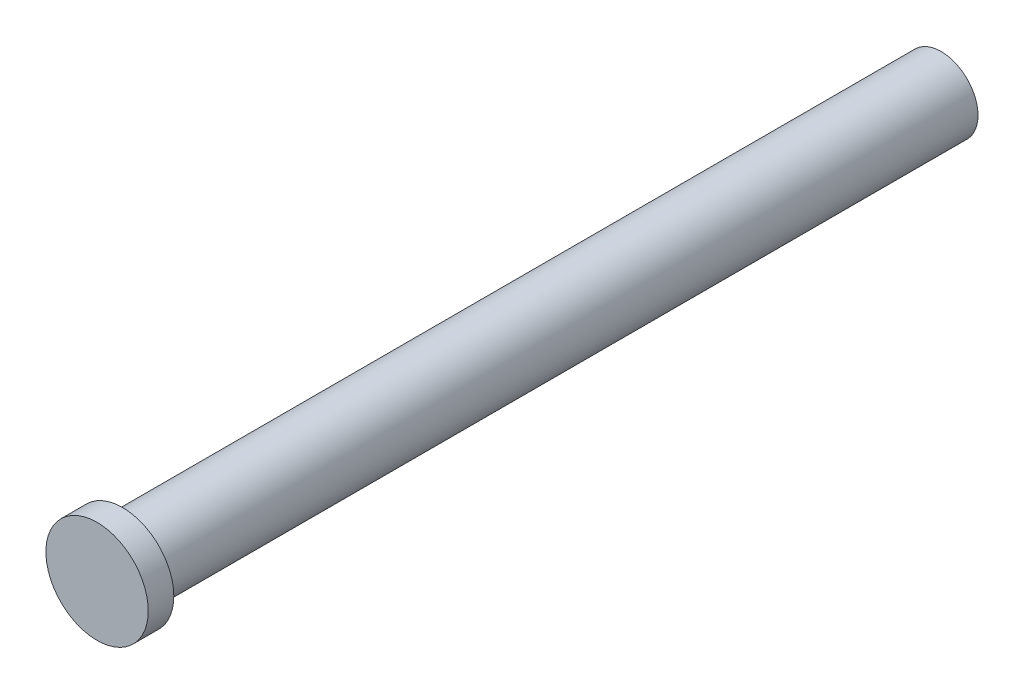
from build123d import *

# Parameters (mm, degrees)
SKETCH1_R           = 4.572
BOSS_EXTRUDE1_DEPTH = 101.6
SKETCH2_R           = 6.35
BOSS_EXTRUDE2_DEPTH = 3.175


with BuildPart() as part:
    # Sketch1 → Boss-Extrude1 (new body)
    with BuildSketch(Plane.XY):
        Circle(SKETCH1_R)
    extrude(amount=BOSS_EXTRUDE1_DEPTH)

    # Sketch2 → Boss-Extrude2 (add)
    with BuildSketch(Plane.XY.offset(101.6)):
        Circle(SKETCH2_R)
    extrude(amount=BOSS_EXTRUDE2_DEPTH)


solid = part.part
